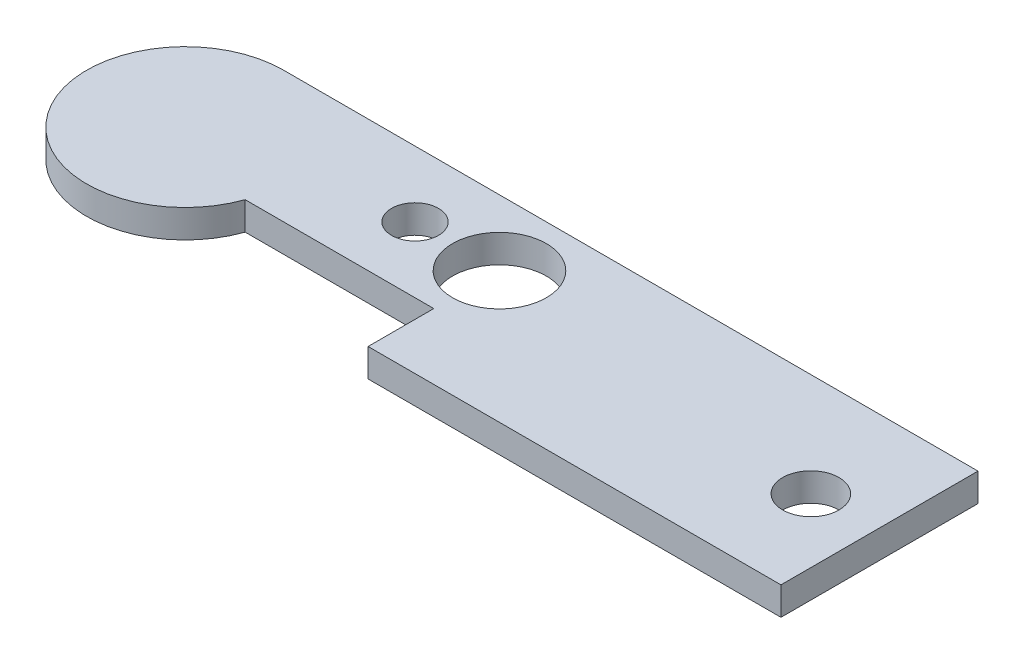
from build123d import *

# Parameters (mm, degrees)
SKETCH1_R      = 2.5
SKETCH1_R_2    = 5
SKETCH1_R_3    = 3
EXTRUDE2_DEPTH = 3


with BuildPart() as part:
    # Sketch1 → Extrude2 (new body)
    with BuildSketch(Plane(origin=(0, 0, 0), x_dir=(1, 0, 0), z_dir=(0, 1, 0))):
        with BuildLine():
            Line((40.5, 0), (84.5, 0))
            Line((84.5, 0), (84.5, 21))
            Line((84.5, 21), (10.5, 21))
            ThreePointArc((10.5, 21), (1.9267859, 4.437822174), (20.399494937, 7))
            Line((20.399494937, 7), (40.5, 7))
            Line((40.5, 7), (40.5, 0))
        make_face()
        with Locations(Location((31.5, 14, 0), (0, 0, 270))):
            Circle(SKETCH1_R, mode=Mode.SUBTRACT)
        with Locations(Location((40.5, 14, 0), (0, 0, 270))):
            Circle(SKETCH1_R_2, mode=Mode.SUBTRACT)
        with Locations(Location((77.685481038, 10, 0), (0, 0, 270))):
            Circle(SKETCH1_R_3, mode=Mode.SUBTRACT)
    extrude(amount=EXTRUDE2_DEPTH)


solid = part.part
